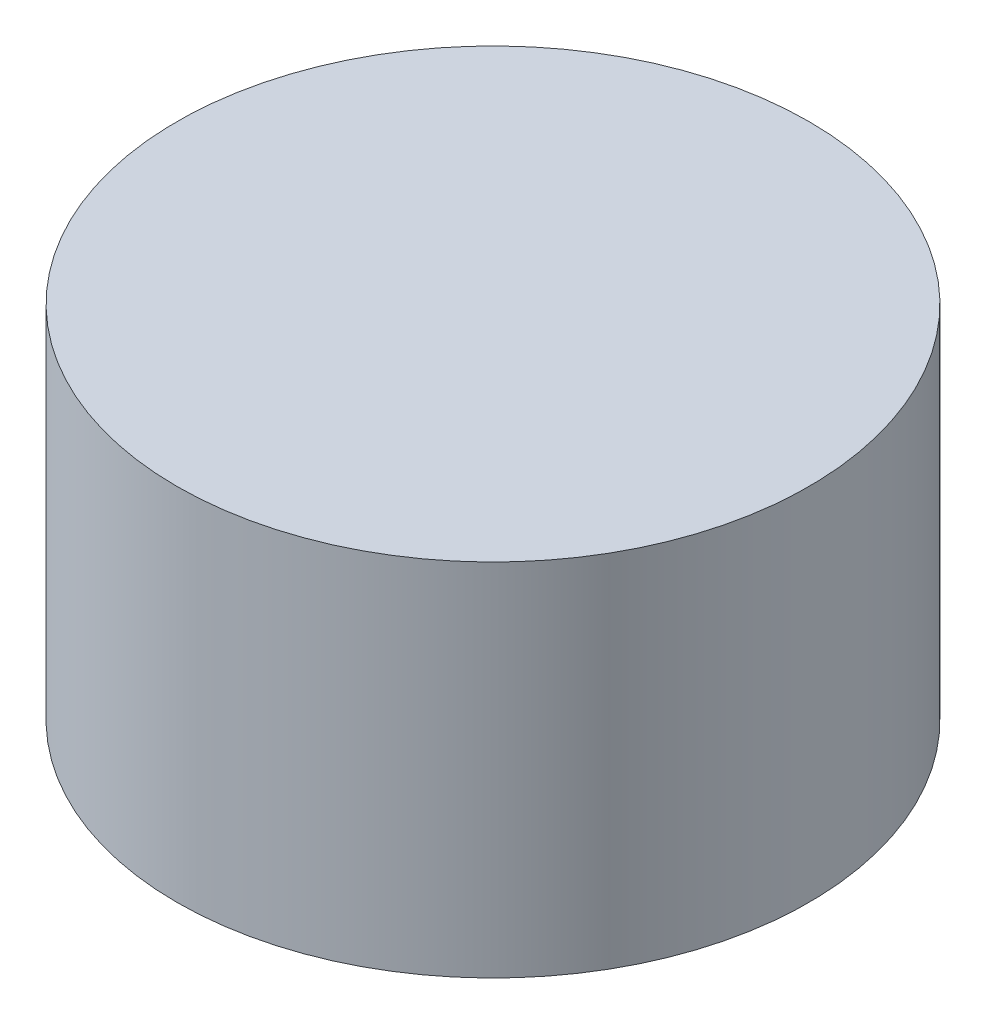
from build123d import *

# Parameters (mm, degrees)
SKETCH1_R           = 12.5
SKETCH1_R_2         = 3
BOSS_EXTRUDE1_DEPTH = 13.25
SKETCH2_R           = 12.5
BOSS_EXTRUDE2_DEPTH = 1
SKETCH3_R           = 7
CUT_EXTRUDE1_DEPTH  = 6.75


with BuildPart() as part:
    # Sketch1 → Boss-Extrude1 (new body)
    with BuildSketch(Plane(origin=(0, 0, 0), x_dir=(1, 0, 0), z_dir=(0, 1, 0))):
        with Locations(Location((0, 0, 0), (0, 0, 270))):
            Circle(SKETCH1_R)
        with Locations(Location((0, 0, 0), (0, 0, 270))):
            Circle(SKETCH1_R_2, mode=Mode.SUBTRACT)
    extrude(amount=BOSS_EXTRUDE1_DEPTH)

    # Sketch2 → Boss-Extrude2 (add)
    with BuildSketch(Plane(origin=(0, 13.25, 0), x_dir=(1, 0, 0), z_dir=(0, 1, 0))):
        with Locations(Location((0, 0, 0), (0, 0, 270))):
            Circle(SKETCH2_R)
    extrude(amount=BOSS_EXTRUDE2_DEPTH)

    # Sketch3 → Cut-Extrude1 (cut)
    with BuildSketch(Plane(origin=(0, 0, 0), x_dir=(-1, 0, 0), z_dir=(0, -1, 0))):
        with Locations(Location((0, 0, 0), (0, 0, 90))):
            Circle(SKETCH3_R)
    extrude(amount=-CUT_EXTRUDE1_DEPTH, mode=Mode.SUBTRACT)


solid = part.part
